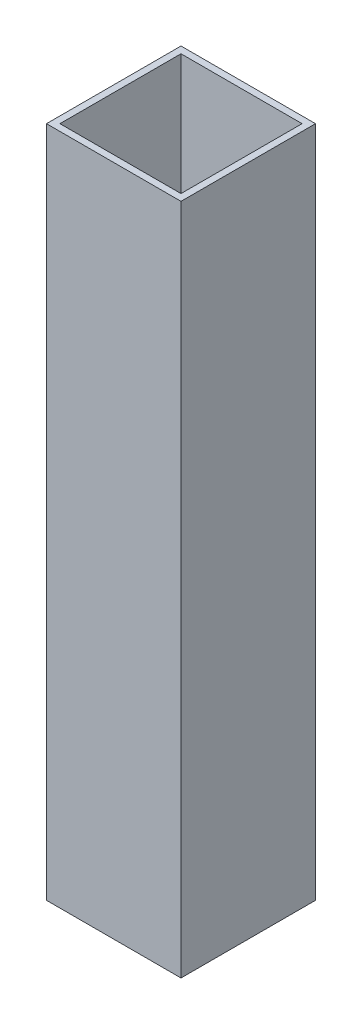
from build123d import *

# Parameters (mm, degrees)
ESQUISSE1_W            = 200
ESQUISSE1_H            = 200
FORME_EXT_RIEURE_DEPTH = 1000
TROU_T                 = -10


with BuildPart() as part:
    # Esquisse1 → Forme ext_rieure (new body)
    with BuildSketch(Plane(origin=(0, 0, 0), x_dir=(1, 0, 0), z_dir=(0, 1, 0))):
        Rectangle(ESQUISSE1_W, ESQUISSE1_H)
    extrude(amount=FORME_EXT_RIEURE_DEPTH)

    # Trou
    trou_openings = [part.faces().sort_by_distance(p)[0] for p in [
        (0, 1000, 0),
        (0, 0, 0),
    ]]
    offset(amount=TROU_T, openings=trou_openings, kind=Kind.INTERSECTION)


solid = part.part
